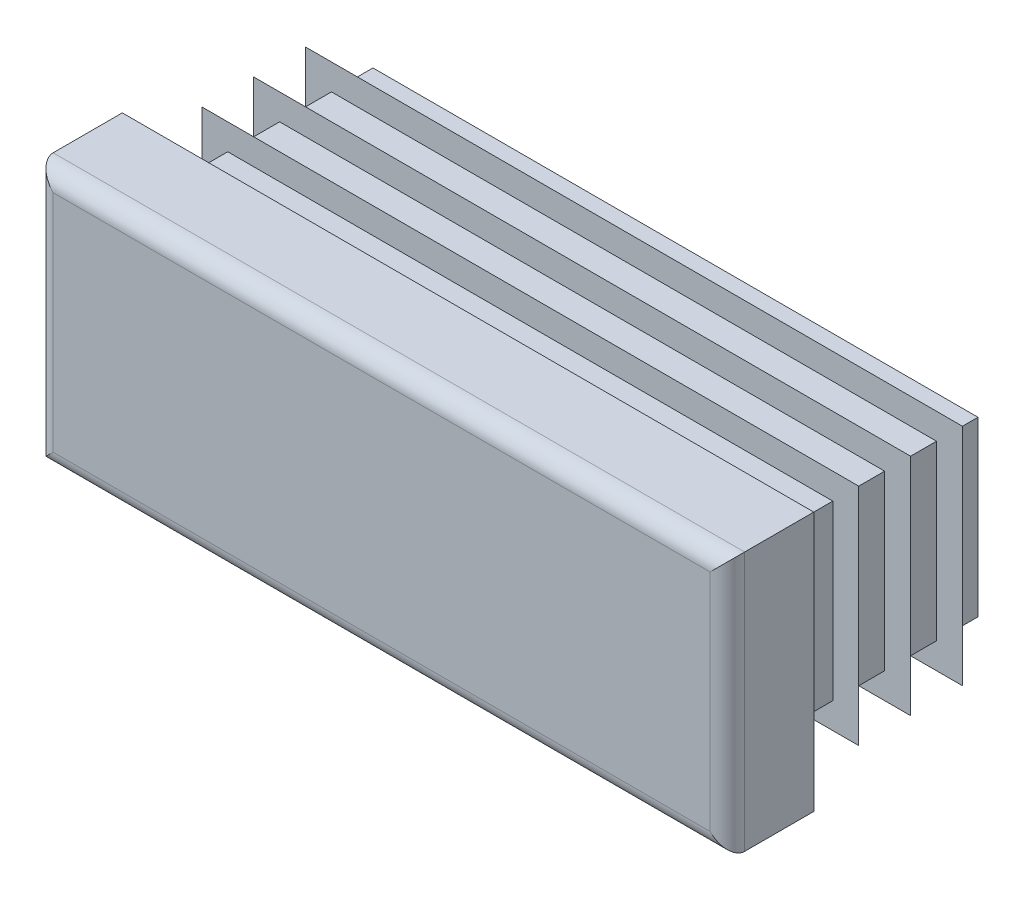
ISO-10303-21;
HEADER;
FILE_DESCRIPTION(('STEP AP214'),'2;1');
FILE_NAME('part.step','',(''),(''),'','','');
FILE_SCHEMA(('AUTOMOTIVE_DESIGN { 1 0 10303 214 1 1 1 1 }'));
ENDSEC;
DATA;
#1=APPLICATION_CONTEXT('core data for automotive mechanical design processes');
#2=APPLICATION_PROTOCOL_DEFINITION('international standard','automotive_design',2000,#1);
#3=PRODUCT_CONTEXT('',#1,'mechanical');
#4=PRODUCT('Part','Part','',(#3));
#5=PRODUCT_RELATED_PRODUCT_CATEGORY('part','',(#4));
#6=PRODUCT_DEFINITION_FORMATION('','',#4);
#7=PRODUCT_DEFINITION_CONTEXT('part definition',#1,'design');
#8=PRODUCT_DEFINITION('design','',#6,#7);
#9=PRODUCT_DEFINITION_SHAPE('','',#8);
#10=(LENGTH_UNIT() NAMED_UNIT(*) SI_UNIT(.MILLI.,.METRE.));
#11=(NAMED_UNIT(*) PLANE_ANGLE_UNIT() SI_UNIT($,.RADIAN.));
#12=(NAMED_UNIT(*) SI_UNIT($,.STERADIAN.) SOLID_ANGLE_UNIT());
#13=UNCERTAINTY_MEASURE_WITH_UNIT(LENGTH_MEASURE(1.E-05),#10,'distance_accuracy_value','');
#14=(GEOMETRIC_REPRESENTATION_CONTEXT(3) GLOBAL_UNCERTAINTY_ASSIGNED_CONTEXT((#13)) GLOBAL_UNIT_ASSIGNED_CONTEXT((#10,
#11,#12)) REPRESENTATION_CONTEXT('',''));
#15=CARTESIAN_POINT('',(0.,0.,0.));
#16=DIRECTION('',(0.,0.,1.));
#17=DIRECTION('',(1.,0.,0.));
#18=AXIS2_PLACEMENT_3D('',#15,#16,#17);
#19=CARTESIAN_POINT('',(19.,-7.5,5.));
#20=DIRECTION('',(0.,0.,-1.));
#21=DIRECTION('',(0.,1.,0.));
#22=AXIS2_PLACEMENT_3D('',#19,#20,#21);
#23=PLANE('',#22);
#24=DIRECTION('',(0.,1.,0.));
#25=VECTOR('',#24,1.);
#26=CARTESIAN_POINT('',(-19.,-7.5,5.));
#27=LINE('',#26,#25);
#28=CARTESIAN_POINT('',(-19.,-6.5,5.));
#29=VERTEX_POINT('',#28);
#30=CARTESIAN_POINT('',(-19.,6.5,5.));
#31=VERTEX_POINT('',#30);
#32=EDGE_CURVE('E310',#29,#31,#27,.T.);
#33=ORIENTED_EDGE('',*,*,#32,.F.);
#34=DIRECTION('',(-1.,0.,0.));
#35=VECTOR('',#34,1.);
#36=CARTESIAN_POINT('',(20.,-6.5,5.));
#37=LINE('',#36,#35);
#38=CARTESIAN_POINT('',(19.,-6.5,5.));
#39=VERTEX_POINT('',#38);
#40=EDGE_CURVE('E482',#39,#29,#37,.T.);
#41=ORIENTED_EDGE('',*,*,#40,.F.);
#42=DIRECTION('',(0.,1.,0.));
#43=VECTOR('',#42,1.);
#44=CARTESIAN_POINT('',(19.,-7.5,5.));
#45=LINE('',#44,#43);
#46=CARTESIAN_POINT('',(19.,6.5,5.));
#47=VERTEX_POINT('',#46);
#48=EDGE_CURVE('E305',#39,#47,#45,.T.);
#49=ORIENTED_EDGE('',*,*,#48,.T.);
#50=DIRECTION('',(-1.,0.,0.));
#51=VECTOR('',#50,1.);
#52=CARTESIAN_POINT('',(20.,6.5,5.));
#53=LINE('',#52,#51);
#54=EDGE_CURVE('E630',#47,#31,#53,.T.);
#55=ORIENTED_EDGE('',*,*,#54,.T.);
#56=EDGE_LOOP('',(#33,#41,#49,#55));
#57=FACE_BOUND('',#56,.T.);
#58=ADVANCED_FACE('F14',(#57),#23,.F.);
#59=CARTESIAN_POINT('',(-19.,-7.5,4.));
#60=DIRECTION('',(0.,1.,0.));
#61=DIRECTION('',(-1.,0.,0.));
#62=AXIS2_PLACEMENT_3D('',#59,#60,#61);
#63=CYLINDRICAL_SURFACE('',#62,1.);
#64=DIRECTION('',(0.,1.,0.));
#65=VECTOR('',#64,1.);
#66=CARTESIAN_POINT('',(-20.,-7.5,4.));
#67=LINE('',#66,#65);
#68=CARTESIAN_POINT('',(-20.,-7.5,4.));
#69=VERTEX_POINT('',#68);
#70=CARTESIAN_POINT('',(-20.,7.5,4.));
#71=VERTEX_POINT('',#70);
#72=EDGE_CURVE('E402',#69,#71,#67,.T.);
#73=ORIENTED_EDGE('',*,*,#72,.F.);
#74=CARTESIAN_POINT('',(-19.,-6.5,4.));
#75=DIRECTION('',(-0.707106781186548,0.707106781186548,0.));
#76=DIRECTION('',(0.707106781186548,0.707106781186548,0.));
#77=AXIS2_PLACEMENT_3D('',#74,#75,#76);
#78=ELLIPSE('',#77,1.41421356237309,1.);
#79=EDGE_CURVE('E59',#69,#29,#78,.T.);
#80=ORIENTED_EDGE('',*,*,#79,.T.);
#81=ORIENTED_EDGE('',*,*,#32,.T.);
#82=CARTESIAN_POINT('',(-19.,6.5,4.));
#83=DIRECTION('',(0.707106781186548,0.707106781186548,0.));
#84=DIRECTION('',(-0.707106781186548,0.707106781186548,0.));
#85=AXIS2_PLACEMENT_3D('',#82,#83,#84);
#86=ELLIPSE('',#85,1.41421356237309,1.);
#87=EDGE_CURVE('E306',#31,#71,#86,.F.);
#88=ORIENTED_EDGE('',*,*,#87,.T.);
#89=EDGE_LOOP('',(#73,#80,#81,#88));
#90=FACE_BOUND('',#89,.T.);
#91=ADVANCED_FACE('F16',(#90),#63,.T.);
#92=CARTESIAN_POINT('',(-20.,-7.5,4.));
#93=DIRECTION('',(1.,0.,0.));
#94=DIRECTION('',(0.,1.,0.));
#95=AXIS2_PLACEMENT_3D('',#92,#93,#94);
#96=PLANE('',#95);
#97=DIRECTION('',(0.,0.,-1.));
#98=VECTOR('',#97,1.);
#99=CARTESIAN_POINT('',(-20.,7.5,4.));
#100=LINE('',#99,#98);
#101=CARTESIAN_POINT('',(-20.,7.5,0.));
#102=VERTEX_POINT('',#101);
#103=EDGE_CURVE('E615',#71,#102,#100,.T.);
#104=ORIENTED_EDGE('',*,*,#103,.T.);
#105=DIRECTION('',(0.,1.,0.));
#106=VECTOR('',#105,1.);
#107=CARTESIAN_POINT('',(-20.,-7.5,0.));
#108=LINE('',#107,#106);
#109=CARTESIAN_POINT('',(-20.,-7.5,0.));
#110=VERTEX_POINT('',#109);
#111=EDGE_CURVE('E400',#110,#102,#108,.T.);
#112=ORIENTED_EDGE('',*,*,#111,.F.);
#113=DIRECTION('',(0.,0.,-1.));
#114=VECTOR('',#113,1.);
#115=CARTESIAN_POINT('',(-20.,-7.5,4.));
#116=LINE('',#115,#114);
#117=EDGE_CURVE('E616',#69,#110,#116,.T.);
#118=ORIENTED_EDGE('',*,*,#117,.F.);
#119=ORIENTED_EDGE('',*,*,#72,.T.);
#120=EDGE_LOOP('',(#104,#112,#118,#119));
#121=FACE_BOUND('',#120,.T.);
#122=ADVANCED_FACE('F697',(#121),#96,.F.);
#123=CARTESIAN_POINT('',(-17.5,-7.5,0.));
#124=DIRECTION('',(1.,0.,0.));
#125=DIRECTION('',(0.,1.,0.));
#126=AXIS2_PLACEMENT_3D('',#123,#124,#125);
#127=PLANE('',#126);
#128=DIRECTION('',(0.,1.,0.));
#129=VECTOR('',#128,1.);
#130=CARTESIAN_POINT('',(-17.5,-7.5,0.));
#131=LINE('',#130,#129);
#132=CARTESIAN_POINT('',(-17.5,-5.,0.));
#133=VERTEX_POINT('',#132);
#134=CARTESIAN_POINT('',(-17.5,5.,0.));
#135=VERTEX_POINT('',#134);
#136=EDGE_CURVE('E397',#133,#135,#131,.T.);
#137=ORIENTED_EDGE('',*,*,#136,.T.);
#138=DIRECTION('',(0.,0.,-1.));
#139=VECTOR('',#138,1.);
#140=CARTESIAN_POINT('',(-17.5,5.,0.));
#141=LINE('',#140,#139);
#142=CARTESIAN_POINT('',(-17.5,5.,-0.6));
#143=VERTEX_POINT('',#142);
#144=EDGE_CURVE('E495',#135,#143,#141,.T.);
#145=ORIENTED_EDGE('',*,*,#144,.T.);
#146=DIRECTION('',(0.,1.,0.));
#147=VECTOR('',#146,1.);
#148=CARTESIAN_POINT('',(-17.5,-7.5,-0.6));
#149=LINE('',#148,#147);
#150=CARTESIAN_POINT('',(-17.5,-5.,-0.6));
#151=VERTEX_POINT('',#150);
#152=EDGE_CURVE('E394',#151,#143,#149,.T.);
#153=ORIENTED_EDGE('',*,*,#152,.F.);
#154=DIRECTION('',(0.,0.,1.));
#155=VECTOR('',#154,1.);
#156=CARTESIAN_POINT('',(-17.5,-5.,0.));
#157=LINE('',#156,#155);
#158=EDGE_CURVE('E489',#151,#133,#157,.T.);
#159=ORIENTED_EDGE('',*,*,#158,.T.);
#160=EDGE_LOOP('',(#137,#145,#153,#159));
#161=FACE_BOUND('',#160,.T.);
#162=ADVANCED_FACE('F787',(#161),#127,.F.);
#163=CARTESIAN_POINT('',(-19.,-7.5,-0.6));
#164=DIRECTION('',(0.342020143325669,0.,0.939692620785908));
#165=DIRECTION('',(-0.939692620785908,0.,0.342020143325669));
#166=AXIS2_PLACEMENT_3D('',#163,#164,#165);
#167=PLANE('',#166);
#168=DIRECTION('',(0.,1.,0.));
#169=VECTOR('',#168,1.);
#170=CARTESIAN_POINT('',(-19.,-7.5,-0.6));
#171=LINE('',#170,#169);
#172=CARTESIAN_POINT('',(-19.,-6.5,-0.6));
#173=VERTEX_POINT('',#172);
#174=CARTESIAN_POINT('',(-19.,6.5,-0.6));
#175=VERTEX_POINT('',#174);
#176=EDGE_CURVE('E392',#173,#175,#171,.T.);
#177=ORIENTED_EDGE('',*,*,#176,.T.);
#178=DIRECTION('',(0.844349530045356,-0.438895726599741,-0.307318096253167));
#179=VECTOR('',#178,1.);
#180=CARTESIAN_POINT('',(-13.8118603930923,3.80318757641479,-2.48832838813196));
#181=LINE('',#180,#179);
#182=CARTESIAN_POINT('',(-17.5,5.7202949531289,-1.1459553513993));
#183=VERTEX_POINT('',#182);
#184=EDGE_CURVE('E519',#175,#183,#181,.T.);
#185=ORIENTED_EDGE('',*,*,#184,.T.);
#186=DIRECTION('',(0.,1.,0.));
#187=VECTOR('',#186,1.);
#188=CARTESIAN_POINT('',(-17.5,-7.5,-1.1459553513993));
#189=LINE('',#188,#187);
#190=CARTESIAN_POINT('',(-17.5,-5.72029495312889,-1.1459553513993));
#191=VERTEX_POINT('',#190);
#192=EDGE_CURVE('E389',#191,#183,#189,.T.);
#193=ORIENTED_EDGE('',*,*,#192,.F.);
#194=DIRECTION('',(-0.844349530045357,-0.438895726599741,0.307318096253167));
#195=VECTOR('',#194,1.);
#196=CARTESIAN_POINT('',(-19.3705814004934,-6.69262945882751,-0.465119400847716));
#197=LINE('',#196,#195);
#198=EDGE_CURVE('E507',#191,#173,#197,.T.);
#199=ORIENTED_EDGE('',*,*,#198,.T.);
#200=EDGE_LOOP('',(#177,#185,#193,#199));
#201=FACE_BOUND('',#200,.T.);
#202=ADVANCED_FACE('F783',(#201),#167,.F.);
#203=CARTESIAN_POINT('',(-17.5,-7.5,-1.1459553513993));
#204=DIRECTION('',(1.,0.,0.));
#205=DIRECTION('',(0.,1.,0.));
#206=AXIS2_PLACEMENT_3D('',#203,#204,#205);
#207=PLANE('',#206);
#208=ORIENTED_EDGE('',*,*,#192,.T.);
#209=DIRECTION('',(0.,-0.819152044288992,-0.573576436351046));
#210=VECTOR('',#209,1.);
#211=CARTESIAN_POINT('',(-17.5,-3.15065611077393,-7.35746215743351));
#212=LINE('',#211,#210);
#213=CARTESIAN_POINT('',(-17.5,5.,-1.65031130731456));
#214=VERTEX_POINT('',#213);
#215=EDGE_CURVE('E516',#183,#214,#212,.T.);
#216=ORIENTED_EDGE('',*,*,#215,.T.);
#217=DIRECTION('',(0.,0.,-1.));
#218=VECTOR('',#217,1.);
#219=CARTESIAN_POINT('',(-17.5,5.,-1.1459553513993));
#220=LINE('',#219,#218);
#221=CARTESIAN_POINT('',(-17.5,5.,-3.6));
#222=VERTEX_POINT('',#221);
#223=EDGE_CURVE('E525',#214,#222,#220,.T.);
#224=ORIENTED_EDGE('',*,*,#223,.T.);
#225=DIRECTION('',(0.,1.,0.));
#226=VECTOR('',#225,1.);
#227=CARTESIAN_POINT('',(-17.5,-7.5,-3.6));
#228=LINE('',#227,#226);
#229=CARTESIAN_POINT('',(-17.5,-5.,-3.6));
#230=VERTEX_POINT('',#229);
#231=EDGE_CURVE('E386',#230,#222,#228,.T.);
#232=ORIENTED_EDGE('',*,*,#231,.F.);
#233=DIRECTION('',(0.,0.,1.));
#234=VECTOR('',#233,1.);
#235=CARTESIAN_POINT('',(-17.5,-5.,-1.1459553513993));
#236=LINE('',#235,#234);
#237=CARTESIAN_POINT('',(-17.5,-5.,-1.65031130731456));
#238=VERTEX_POINT('',#237);
#239=EDGE_CURVE('E522',#230,#238,#236,.T.);
#240=ORIENTED_EDGE('',*,*,#239,.T.);
#241=DIRECTION('',(0.,-0.819152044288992,0.573576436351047));
#242=VECTOR('',#241,1.);
#243=CARTESIAN_POINT('',(-17.5,-6.91449496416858,-0.309767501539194));
#244=LINE('',#243,#242);
#245=EDGE_CURVE('E504',#238,#191,#244,.T.);
#246=ORIENTED_EDGE('',*,*,#245,.T.);
#247=EDGE_LOOP('',(#208,#216,#224,#232,#240,#246));
#248=FACE_BOUND('',#247,.T.);
#249=ADVANCED_FACE('F779',(#248),#207,.F.);
#250=CARTESIAN_POINT('',(-19.,-7.5,-3.6));
#251=DIRECTION('',(0.342020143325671,0.,0.939692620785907));
#252=DIRECTION('',(-0.939692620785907,0.,0.342020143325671));
#253=AXIS2_PLACEMENT_3D('',#250,#251,#252);
#254=PLANE('',#253);
#255=DIRECTION('',(0.,1.,0.));
#256=VECTOR('',#255,1.);
#257=CARTESIAN_POINT('',(-19.,-7.5,-3.6));
#258=LINE('',#257,#256);
#259=CARTESIAN_POINT('',(-19.,-6.5,-3.6));
#260=VERTEX_POINT('',#259);
#261=CARTESIAN_POINT('',(-19.,6.5,-3.6));
#262=VERTEX_POINT('',#261);
#263=EDGE_CURVE('E384',#260,#262,#258,.T.);
#264=ORIENTED_EDGE('',*,*,#263,.T.);
#265=DIRECTION('',(0.844349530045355,-0.438895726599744,-0.307318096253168));
#266=VECTOR('',#265,1.);
#267=CARTESIAN_POINT('',(-13.8118603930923,3.80318757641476,-5.48832838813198));
#268=LINE('',#267,#266);
#269=CARTESIAN_POINT('',(-17.5,5.72029495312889,-4.14595535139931));
#270=VERTEX_POINT('',#269);
#271=EDGE_CURVE('E549',#262,#270,#268,.T.);
#272=ORIENTED_EDGE('',*,*,#271,.T.);
#273=DIRECTION('',(0.,1.,0.));
#274=VECTOR('',#273,1.);
#275=CARTESIAN_POINT('',(-17.5,-7.5,-4.14595535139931));
#276=LINE('',#275,#274);
#277=CARTESIAN_POINT('',(-17.5,-5.72029495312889,-4.14595535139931));
#278=VERTEX_POINT('',#277);
#279=EDGE_CURVE('E381',#278,#270,#276,.T.);
#280=ORIENTED_EDGE('',*,*,#279,.F.);
#281=DIRECTION('',(-0.844349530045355,-0.438895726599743,0.307318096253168));
#282=VECTOR('',#281,1.);
#283=CARTESIAN_POINT('',(-19.3705814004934,-6.69262945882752,-3.46511940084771));
#284=LINE('',#283,#282);
#285=EDGE_CURVE('E537',#278,#260,#284,.T.);
#286=ORIENTED_EDGE('',*,*,#285,.T.);
#287=EDGE_LOOP('',(#264,#272,#280,#286));
#288=FACE_BOUND('',#287,.T.);
#289=ADVANCED_FACE('F775',(#288),#254,.F.);
#290=CARTESIAN_POINT('',(-17.5,-7.5,-4.14595535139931));
#291=DIRECTION('',(1.,0.,0.));
#292=DIRECTION('',(0.,1.,0.));
#293=AXIS2_PLACEMENT_3D('',#290,#291,#292);
#294=PLANE('',#293);
#295=ORIENTED_EDGE('',*,*,#279,.T.);
#296=DIRECTION('',(0.,-0.819152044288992,-0.573576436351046));
#297=VECTOR('',#296,1.);
#298=CARTESIAN_POINT('',(-17.5,-3.15065611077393,-10.3574621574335));
#299=LINE('',#298,#297);
#300=CARTESIAN_POINT('',(-17.5,5.,-4.65031130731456));
#301=VERTEX_POINT('',#300);
#302=EDGE_CURVE('E546',#270,#301,#299,.T.);
#303=ORIENTED_EDGE('',*,*,#302,.T.);
#304=DIRECTION('',(0.,0.,-1.));
#305=VECTOR('',#304,1.);
#306=CARTESIAN_POINT('',(-17.5,5.,-4.14595535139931));
#307=LINE('',#306,#305);
#308=CARTESIAN_POINT('',(-17.5,5.,-6.6));
#309=VERTEX_POINT('',#308);
#310=EDGE_CURVE('E555',#301,#309,#307,.T.);
#311=ORIENTED_EDGE('',*,*,#310,.T.);
#312=DIRECTION('',(0.,1.,0.));
#313=VECTOR('',#312,1.);
#314=CARTESIAN_POINT('',(-17.5,-7.5,-6.6));
#315=LINE('',#314,#313);
#316=CARTESIAN_POINT('',(-17.5,-5.,-6.6));
#317=VERTEX_POINT('',#316);
#318=EDGE_CURVE('E378',#317,#309,#315,.T.);
#319=ORIENTED_EDGE('',*,*,#318,.F.);
#320=DIRECTION('',(0.,0.,1.));
#321=VECTOR('',#320,1.);
#322=CARTESIAN_POINT('',(-17.5,-5.,-4.14595535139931));
#323=LINE('',#322,#321);
#324=CARTESIAN_POINT('',(-17.5,-5.,-4.65031130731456));
#325=VERTEX_POINT('',#324);
#326=EDGE_CURVE('E552',#317,#325,#323,.T.);
#327=ORIENTED_EDGE('',*,*,#326,.T.);
#328=DIRECTION('',(0.,-0.819152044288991,0.573576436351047));
#329=VECTOR('',#328,1.);
#330=CARTESIAN_POINT('',(-17.5,-6.91449496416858,-3.30976750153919));
#331=LINE('',#330,#329);
#332=EDGE_CURVE('E534',#325,#278,#331,.T.);
#333=ORIENTED_EDGE('',*,*,#332,.T.);
#334=EDGE_LOOP('',(#295,#303,#311,#319,#327,#333));
#335=FACE_BOUND('',#334,.T.);
#336=ADVANCED_FACE('F771',(#335),#294,.F.);
#337=CARTESIAN_POINT('',(-19.,-7.5,-6.6));
#338=DIRECTION('',(0.342020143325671,0.,0.939692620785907));
#339=DIRECTION('',(-0.939692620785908,0.,0.342020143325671));
#340=AXIS2_PLACEMENT_3D('',#337,#338,#339);
#341=PLANE('',#340);
#342=DIRECTION('',(0.,1.,0.));
#343=VECTOR('',#342,1.);
#344=CARTESIAN_POINT('',(-19.,-7.5,-6.6));
#345=LINE('',#344,#343);
#346=CARTESIAN_POINT('',(-19.,-6.5,-6.6));
#347=VERTEX_POINT('',#346);
#348=CARTESIAN_POINT('',(-19.,6.5,-6.6));
#349=VERTEX_POINT('',#348);
#350=EDGE_CURVE('E376',#347,#349,#345,.T.);
#351=ORIENTED_EDGE('',*,*,#350,.T.);
#352=DIRECTION('',(0.844349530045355,-0.438895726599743,-0.307318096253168));
#353=VECTOR('',#352,1.);
#354=CARTESIAN_POINT('',(-13.8118603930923,3.80318757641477,-8.48832838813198));
#355=LINE('',#354,#353);
#356=CARTESIAN_POINT('',(-17.5,5.7202949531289,-7.1459553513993));
#357=VERTEX_POINT('',#356);
#358=EDGE_CURVE('E579',#349,#357,#355,.T.);
#359=ORIENTED_EDGE('',*,*,#358,.T.);
#360=DIRECTION('',(0.,1.,0.));
#361=VECTOR('',#360,1.);
#362=CARTESIAN_POINT('',(-17.5,-7.5,-7.1459553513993));
#363=LINE('',#362,#361);
#364=CARTESIAN_POINT('',(-17.5,-5.72029495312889,-7.1459553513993));
#365=VERTEX_POINT('',#364);
#366=EDGE_CURVE('E373',#365,#357,#363,.T.);
#367=ORIENTED_EDGE('',*,*,#366,.F.);
#368=DIRECTION('',(-0.844349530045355,-0.438895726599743,0.307318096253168));
#369=VECTOR('',#368,1.);
#370=CARTESIAN_POINT('',(-19.3705814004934,-6.69262945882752,-6.46511940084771));
#371=LINE('',#370,#369);
#372=EDGE_CURVE('E567',#365,#347,#371,.T.);
#373=ORIENTED_EDGE('',*,*,#372,.T.);
#374=EDGE_LOOP('',(#351,#359,#367,#373));
#375=FACE_BOUND('',#374,.T.);
#376=ADVANCED_FACE('F767',(#375),#341,.F.);
#377=CARTESIAN_POINT('',(-17.5,-7.5,-7.1459553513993));
#378=DIRECTION('',(1.,0.,0.));
#379=DIRECTION('',(0.,1.,0.));
#380=AXIS2_PLACEMENT_3D('',#377,#378,#379);
#381=PLANE('',#380);
#382=ORIENTED_EDGE('',*,*,#366,.T.);
#383=DIRECTION('',(0.,-0.819152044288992,-0.573576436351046));
#384=VECTOR('',#383,1.);
#385=CARTESIAN_POINT('',(-17.5,-3.15065611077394,-13.3574621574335));
#386=LINE('',#385,#384);
#387=CARTESIAN_POINT('',(-17.5,5.,-7.65031130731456));
#388=VERTEX_POINT('',#387);
#389=EDGE_CURVE('E576',#357,#388,#386,.T.);
#390=ORIENTED_EDGE('',*,*,#389,.T.);
#391=DIRECTION('',(0.,0.,-1.));
#392=VECTOR('',#391,1.);
#393=CARTESIAN_POINT('',(-17.5,5.,-7.1459553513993));
#394=LINE('',#393,#392);
#395=CARTESIAN_POINT('',(-17.5,5.,-9.6));
#396=VERTEX_POINT('',#395);
#397=EDGE_CURVE('E585',#388,#396,#394,.T.);
#398=ORIENTED_EDGE('',*,*,#397,.T.);
#399=DIRECTION('',(0.,1.,0.));
#400=VECTOR('',#399,1.);
#401=CARTESIAN_POINT('',(-17.5,-7.5,-9.6));
#402=LINE('',#401,#400);
#403=CARTESIAN_POINT('',(-17.5,-5.,-9.6));
#404=VERTEX_POINT('',#403);
#405=EDGE_CURVE('E370',#404,#396,#402,.T.);
#406=ORIENTED_EDGE('',*,*,#405,.F.);
#407=DIRECTION('',(0.,0.,1.));
#408=VECTOR('',#407,1.);
#409=CARTESIAN_POINT('',(-17.5,-5.,-7.1459553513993));
#410=LINE('',#409,#408);
#411=CARTESIAN_POINT('',(-17.5,-5.,-7.65031130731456));
#412=VERTEX_POINT('',#411);
#413=EDGE_CURVE('E582',#404,#412,#410,.T.);
#414=ORIENTED_EDGE('',*,*,#413,.T.);
#415=DIRECTION('',(0.,-0.819152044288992,0.573576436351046));
#416=VECTOR('',#415,1.);
#417=CARTESIAN_POINT('',(-17.5,-6.91449496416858,-6.30976750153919));
#418=LINE('',#417,#416);
#419=EDGE_CURVE('E564',#412,#365,#418,.T.);
#420=ORIENTED_EDGE('',*,*,#419,.T.);
#421=EDGE_LOOP('',(#382,#390,#398,#406,#414,#420));
#422=FACE_BOUND('',#421,.T.);
#423=ADVANCED_FACE('F764',(#422),#381,.F.);
#424=CARTESIAN_POINT('',(-19.,-7.5,-9.6));
#425=DIRECTION('',(0.342020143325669,0.,0.939692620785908));
#426=DIRECTION('',(-0.939692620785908,0.,0.342020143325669));
#427=AXIS2_PLACEMENT_3D('',#424,#425,#426);
#428=PLANE('',#427);
#429=DIRECTION('',(0.,1.,0.));
#430=VECTOR('',#429,1.);
#431=CARTESIAN_POINT('',(-19.,-7.5,-9.6));
#432=LINE('',#431,#430);
#433=CARTESIAN_POINT('',(-19.,-6.5,-9.6));
#434=VERTEX_POINT('',#433);
#435=CARTESIAN_POINT('',(-19.,6.5,-9.6));
#436=VERTEX_POINT('',#435);
#437=EDGE_CURVE('E368',#434,#436,#432,.T.);
#438=ORIENTED_EDGE('',*,*,#437,.T.);
#439=DIRECTION('',(0.844349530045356,-0.438895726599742,-0.307318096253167));
#440=VECTOR('',#439,1.);
#441=CARTESIAN_POINT('',(-13.8118603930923,3.80318757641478,-11.488328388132));
#442=LINE('',#441,#440);
#443=CARTESIAN_POINT('',(-17.5,5.7202949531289,-10.1459553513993));
#444=VERTEX_POINT('',#443);
#445=EDGE_CURVE('E607',#436,#444,#442,.T.);
#446=ORIENTED_EDGE('',*,*,#445,.T.);
#447=DIRECTION('',(0.,1.,0.));
#448=VECTOR('',#447,1.);
#449=CARTESIAN_POINT('',(-17.5,-7.5,-10.1459553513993));
#450=LINE('',#449,#448);
#451=CARTESIAN_POINT('',(-17.5,-5.7202949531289,-10.1459553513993));
#452=VERTEX_POINT('',#451);
#453=EDGE_CURVE('E365',#452,#444,#450,.T.);
#454=ORIENTED_EDGE('',*,*,#453,.F.);
#455=DIRECTION('',(-0.844349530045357,-0.438895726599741,0.307318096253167));
#456=VECTOR('',#455,1.);
#457=CARTESIAN_POINT('',(-19.3705814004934,-6.69262945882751,-9.46511940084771));
#458=LINE('',#457,#456);
#459=EDGE_CURVE('E595',#452,#434,#458,.T.);
#460=ORIENTED_EDGE('',*,*,#459,.T.);
#461=EDGE_LOOP('',(#438,#446,#454,#460));
#462=FACE_BOUND('',#461,.T.);
#463=ADVANCED_FACE('F675',(#462),#428,.F.);
#464=CARTESIAN_POINT('',(-17.5,-7.5,-10.1459553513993));
#465=DIRECTION('',(1.,0.,0.));
#466=DIRECTION('',(0.,1.,0.));
#467=AXIS2_PLACEMENT_3D('',#464,#465,#466);
#468=PLANE('',#467);
#469=ORIENTED_EDGE('',*,*,#453,.T.);
#470=DIRECTION('',(0.,-0.819152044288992,-0.573576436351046));
#471=VECTOR('',#470,1.);
#472=CARTESIAN_POINT('',(-17.5,-3.15065611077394,-16.3574621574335));
#473=LINE('',#472,#471);
#474=CARTESIAN_POINT('',(-17.5,5.,-10.6503113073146));
#475=VERTEX_POINT('',#474);
#476=EDGE_CURVE('E604',#444,#475,#473,.T.);
#477=ORIENTED_EDGE('',*,*,#476,.T.);
#478=DIRECTION('',(0.,0.,-1.));
#479=VECTOR('',#478,1.);
#480=CARTESIAN_POINT('',(-17.5,5.,-10.1459553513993));
#481=LINE('',#480,#479);
#482=CARTESIAN_POINT('',(-17.5,5.,-12.));
#483=VERTEX_POINT('',#482);
#484=EDGE_CURVE('E613',#475,#483,#481,.T.);
#485=ORIENTED_EDGE('',*,*,#484,.T.);
#486=DIRECTION('',(0.,1.,0.));
#487=VECTOR('',#486,1.);
#488=CARTESIAN_POINT('',(-17.5,-7.5,-12.));
#489=LINE('',#488,#487);
#490=CARTESIAN_POINT('',(-17.5,-5.,-12.));
#491=VERTEX_POINT('',#490);
#492=EDGE_CURVE('E362',#491,#483,#489,.T.);
#493=ORIENTED_EDGE('',*,*,#492,.F.);
#494=DIRECTION('',(0.,0.,1.));
#495=VECTOR('',#494,1.);
#496=CARTESIAN_POINT('',(-17.5,-5.,-10.1459553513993));
#497=LINE('',#496,#495);
#498=CARTESIAN_POINT('',(-17.5,-5.,-10.6503113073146));
#499=VERTEX_POINT('',#498);
#500=EDGE_CURVE('E610',#491,#499,#497,.T.);
#501=ORIENTED_EDGE('',*,*,#500,.T.);
#502=DIRECTION('',(0.,-0.819152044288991,0.573576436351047));
#503=VECTOR('',#502,1.);
#504=CARTESIAN_POINT('',(-17.5,-6.91449496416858,-9.30976750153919));
#505=LINE('',#504,#503);
#506=EDGE_CURVE('E592',#499,#452,#505,.T.);
#507=ORIENTED_EDGE('',*,*,#506,.T.);
#508=EDGE_LOOP('',(#469,#477,#485,#493,#501,#507));
#509=FACE_BOUND('',#508,.T.);
#510=ADVANCED_FACE('F677',(#509),#468,.F.);
#511=CARTESIAN_POINT('',(-17.5,-7.5,-12.));
#512=DIRECTION('',(0.,0.,1.));
#513=DIRECTION('',(0.,-1.,0.));
#514=AXIS2_PLACEMENT_3D('',#511,#512,#513);
#515=PLANE('',#514);
#516=ORIENTED_EDGE('',*,*,#492,.T.);
#517=DIRECTION('',(-1.,0.,0.));
#518=VECTOR('',#517,1.);
#519=CARTESIAN_POINT('',(20.,5.,-12.));
#520=LINE('',#519,#518);
#521=CARTESIAN_POINT('',(17.5,5.,-12.));
#522=VERTEX_POINT('',#521);
#523=EDGE_CURVE('E438',#522,#483,#520,.T.);
#524=ORIENTED_EDGE('',*,*,#523,.F.);
#525=DIRECTION('',(0.,1.,0.));
#526=VECTOR('',#525,1.);
#527=CARTESIAN_POINT('',(17.5,-7.5,-12.));
#528=LINE('',#527,#526);
#529=CARTESIAN_POINT('',(17.5,-5.,-12.));
#530=VERTEX_POINT('',#529);
#531=EDGE_CURVE('E359',#530,#522,#528,.T.);
#532=ORIENTED_EDGE('',*,*,#531,.F.);
#533=DIRECTION('',(-1.,0.,0.));
#534=VECTOR('',#533,1.);
#535=CARTESIAN_POINT('',(20.,-5.,-12.));
#536=LINE('',#535,#534);
#537=EDGE_CURVE('E436',#530,#491,#536,.T.);
#538=ORIENTED_EDGE('',*,*,#537,.T.);
#539=EDGE_LOOP('',(#516,#524,#532,#538));
#540=FACE_BOUND('',#539,.T.);
#541=ADVANCED_FACE('F435',(#540),#515,.F.);
#542=CARTESIAN_POINT('',(17.5,-7.5,-12.));
#543=DIRECTION('',(-1.,0.,0.));
#544=DIRECTION('',(0.,-1.,0.));
#545=AXIS2_PLACEMENT_3D('',#542,#543,#544);
#546=PLANE('',#545);
#547=DIRECTION('',(0.,0.,1.));
#548=VECTOR('',#547,1.);
#549=CARTESIAN_POINT('',(17.5,5.,-12.));
#550=LINE('',#549,#548);
#551=CARTESIAN_POINT('',(17.5,5.,-10.6503113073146));
#552=VERTEX_POINT('',#551);
#553=EDGE_CURVE('E9',#522,#552,#550,.T.);
#554=ORIENTED_EDGE('',*,*,#553,.T.);
#555=DIRECTION('',(0.,0.819152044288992,0.573576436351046));
#556=VECTOR('',#555,1.);
#557=CARTESIAN_POINT('',(17.5,-4.02177214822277,-16.9674241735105));
#558=LINE('',#557,#556);
#559=CARTESIAN_POINT('',(17.5,5.72029495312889,-10.1459553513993));
#560=VERTEX_POINT('',#559);
#561=EDGE_CURVE('E601',#552,#560,#558,.T.);
#562=ORIENTED_EDGE('',*,*,#561,.T.);
#563=DIRECTION('',(0.,1.,0.));
#564=VECTOR('',#563,1.);
#565=CARTESIAN_POINT('',(17.5,-7.5,-10.1459553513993));
#566=LINE('',#565,#564);
#567=CARTESIAN_POINT('',(17.5,-5.72029495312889,-10.1459553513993));
#568=VERTEX_POINT('',#567);
#569=EDGE_CURVE('E356',#568,#560,#566,.T.);
#570=ORIENTED_EDGE('',*,*,#569,.F.);
#571=DIRECTION('',(0.,0.819152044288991,-0.573576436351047));
#572=VECTOR('',#571,1.);
#573=CARTESIAN_POINT('',(17.5,-6.04337892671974,-9.91972951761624));
#574=LINE('',#573,#572);
#575=CARTESIAN_POINT('',(17.5,-5.,-10.6503113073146));
#576=VERTEX_POINT('',#575);
#577=EDGE_CURVE('E428',#568,#576,#574,.T.);
#578=ORIENTED_EDGE('',*,*,#577,.T.);
#579=DIRECTION('',(0.,0.,-1.));
#580=VECTOR('',#579,1.);
#581=CARTESIAN_POINT('',(17.5,-5.,-12.));
#582=LINE('',#581,#580);
#583=EDGE_CURVE('E23',#576,#530,#582,.T.);
#584=ORIENTED_EDGE('',*,*,#583,.T.);
#585=ORIENTED_EDGE('',*,*,#531,.T.);
#586=EDGE_LOOP('',(#554,#562,#570,#578,#584,#585));
#587=FACE_BOUND('',#586,.T.);
#588=ADVANCED_FACE('F426',(#587),#546,.F.);
#589=CARTESIAN_POINT('',(17.5,-7.5,-10.1459553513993));
#590=DIRECTION('',(-0.342020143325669,0.,0.939692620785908));
#591=DIRECTION('',(-0.939692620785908,0.,-0.342020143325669));
#592=AXIS2_PLACEMENT_3D('',#589,#590,#591);
#593=PLANE('',#592);
#594=ORIENTED_EDGE('',*,*,#569,.T.);
#595=DIRECTION('',(0.844349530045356,0.438895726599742,0.307318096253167));
#596=VECTOR('',#595,1.);
#597=CARTESIAN_POINT('',(12.6008045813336,3.17367669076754,-11.9291166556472));
#598=LINE('',#597,#596);
#599=CARTESIAN_POINT('',(19.,6.5,-9.6));
#600=VERTEX_POINT('',#599);
#601=EDGE_CURVE('E598',#560,#600,#598,.T.);
#602=ORIENTED_EDGE('',*,*,#601,.T.);
#603=DIRECTION('',(0.,1.,0.));
#604=VECTOR('',#603,1.);
#605=CARTESIAN_POINT('',(19.,-7.5,-9.6));
#606=LINE('',#605,#604);
#607=CARTESIAN_POINT('',(19.,-6.5,-9.6));
#608=VERTEX_POINT('',#607);
#609=EDGE_CURVE('E353',#608,#600,#606,.T.);
#610=ORIENTED_EDGE('',*,*,#609,.F.);
#611=DIRECTION('',(-0.844349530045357,0.438895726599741,-0.307318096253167));
#612=VECTOR('',#611,1.);
#613=CARTESIAN_POINT('',(18.1595255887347,-6.06311857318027,-9.90590766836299));
#614=LINE('',#613,#612);
#615=EDGE_CURVE('E588',#608,#568,#614,.T.);
#616=ORIENTED_EDGE('',*,*,#615,.T.);
#617=EDGE_LOOP('',(#594,#602,#610,#616));
#618=FACE_BOUND('',#617,.T.);
#619=ADVANCED_FACE('F752',(#618),#593,.F.);
#620=CARTESIAN_POINT('',(19.,-7.5,-9.6));
#621=DIRECTION('',(0.,0.,-1.));
#622=DIRECTION('',(0.,1.,0.));
#623=AXIS2_PLACEMENT_3D('',#620,#621,#622);
#624=PLANE('',#623);
#625=ORIENTED_EDGE('',*,*,#609,.T.);
#626=DIRECTION('',(-1.,0.,0.));
#627=VECTOR('',#626,1.);
#628=CARTESIAN_POINT('',(20.,6.5,-9.6));
#629=LINE('',#628,#627);
#630=EDGE_CURVE('E444',#600,#436,#629,.T.);
#631=ORIENTED_EDGE('',*,*,#630,.T.);
#632=ORIENTED_EDGE('',*,*,#437,.F.);
#633=DIRECTION('',(-1.,0.,0.));
#634=VECTOR('',#633,1.);
#635=CARTESIAN_POINT('',(20.,-6.5,-9.6));
#636=LINE('',#635,#634);
#637=EDGE_CURVE('E451',#608,#434,#636,.T.);
#638=ORIENTED_EDGE('',*,*,#637,.F.);
#639=EDGE_LOOP('',(#625,#631,#632,#638));
#640=FACE_BOUND('',#639,.T.);
#641=ORIENTED_EDGE('',*,*,#405,.T.);
#642=DIRECTION('',(-1.,0.,0.));
#643=VECTOR('',#642,1.);
#644=CARTESIAN_POINT('',(20.,5.,-9.6));
#645=LINE('',#644,#643);
#646=CARTESIAN_POINT('',(17.5,5.,-9.6));
#647=VERTEX_POINT('',#646);
#648=EDGE_CURVE('E663',#647,#396,#645,.T.);
#649=ORIENTED_EDGE('',*,*,#648,.F.);
#650=DIRECTION('',(0.,1.,0.));
#651=VECTOR('',#650,1.);
#652=CARTESIAN_POINT('',(17.5,-7.5,-9.6));
#653=LINE('',#652,#651);
#654=CARTESIAN_POINT('',(17.5,-5.,-9.6));
#655=VERTEX_POINT('',#654);
#656=EDGE_CURVE('E350',#655,#647,#653,.T.);
#657=ORIENTED_EDGE('',*,*,#656,.F.);
#658=DIRECTION('',(-1.,0.,0.));
#659=VECTOR('',#658,1.);
#660=CARTESIAN_POINT('',(20.,-5.,-9.6));
#661=LINE('',#660,#659);
#662=EDGE_CURVE('E453',#655,#404,#661,.T.);
#663=ORIENTED_EDGE('',*,*,#662,.T.);
#664=EDGE_LOOP('',(#641,#649,#657,#663));
#665=FACE_BOUND('',#664,.T.);
#666=ADVANCED_FACE('F667',(#640,#665),#624,.F.);
#667=CARTESIAN_POINT('',(17.5,-7.5,-9.6));
#668=DIRECTION('',(-1.,0.,0.));
#669=DIRECTION('',(0.,-1.,0.));
#670=AXIS2_PLACEMENT_3D('',#667,#668,#669);
#671=PLANE('',#670);
#672=DIRECTION('',(0.,0.,1.));
#673=VECTOR('',#672,1.);
#674=CARTESIAN_POINT('',(17.5,5.,-9.6));
#675=LINE('',#674,#673);
#676=CARTESIAN_POINT('',(17.5,5.,-7.65031130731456));
#677=VERTEX_POINT('',#676);
#678=EDGE_CURVE('E420',#647,#677,#675,.T.);
#679=ORIENTED_EDGE('',*,*,#678,.T.);
#680=DIRECTION('',(0.,0.819152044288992,0.573576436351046));
#681=VECTOR('',#680,1.);
#682=CARTESIAN_POINT('',(17.5,-4.30367993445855,-14.1648181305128));
#683=LINE('',#682,#681);
#684=CARTESIAN_POINT('',(17.5,5.72029495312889,-7.1459553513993));
#685=VERTEX_POINT('',#684);
#686=EDGE_CURVE('E573',#677,#685,#683,.T.);
#687=ORIENTED_EDGE('',*,*,#686,.T.);
#688=DIRECTION('',(0.,1.,0.));
#689=VECTOR('',#688,1.);
#690=CARTESIAN_POINT('',(17.5,-7.5,-7.1459553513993));
#691=LINE('',#690,#689);
#692=CARTESIAN_POINT('',(17.5,-5.72029495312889,-7.1459553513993));
#693=VERTEX_POINT('',#692);
#694=EDGE_CURVE('E347',#693,#685,#691,.T.);
#695=ORIENTED_EDGE('',*,*,#694,.F.);
#696=DIRECTION('',(0.,0.819152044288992,-0.573576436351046));
#697=VECTOR('',#696,1.);
#698=CARTESIAN_POINT('',(17.5,-5.76147114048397,-7.11712347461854));
#699=LINE('',#698,#697);
#700=CARTESIAN_POINT('',(17.5,-5.,-7.65031130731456));
#701=VERTEX_POINT('',#700);
#702=EDGE_CURVE('E561',#693,#701,#699,.T.);
#703=ORIENTED_EDGE('',*,*,#702,.T.);
#704=DIRECTION('',(0.,0.,-1.));
#705=VECTOR('',#704,1.);
#706=CARTESIAN_POINT('',(17.5,-5.,-9.6));
#707=LINE('',#706,#705);
#708=EDGE_CURVE('E417',#701,#655,#707,.T.);
#709=ORIENTED_EDGE('',*,*,#708,.T.);
#710=ORIENTED_EDGE('',*,*,#656,.T.);
#711=EDGE_LOOP('',(#679,#687,#695,#703,#709,#710));
#712=FACE_BOUND('',#711,.T.);
#713=ADVANCED_FACE('F745',(#712),#671,.F.);
#714=CARTESIAN_POINT('',(17.5,-7.5,-7.1459553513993));
#715=DIRECTION('',(-0.342020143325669,0.,0.939692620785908));
#716=DIRECTION('',(-0.939692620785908,0.,-0.342020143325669));
#717=AXIS2_PLACEMENT_3D('',#714,#715,#716);
#718=PLANE('',#717);
#719=ORIENTED_EDGE('',*,*,#694,.T.);
#720=DIRECTION('',(0.844349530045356,0.438895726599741,0.307318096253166));
#721=VECTOR('',#720,1.);
#722=CARTESIAN_POINT('',(12.6008045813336,3.17367669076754,-8.92911665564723));
#723=LINE('',#722,#721);
#724=CARTESIAN_POINT('',(19.,6.5,-6.6));
#725=VERTEX_POINT('',#724);
#726=EDGE_CURVE('E570',#685,#725,#723,.T.);
#727=ORIENTED_EDGE('',*,*,#726,.T.);
#728=DIRECTION('',(0.,1.,0.));
#729=VECTOR('',#728,1.);
#730=CARTESIAN_POINT('',(19.,-7.5,-6.6));
#731=LINE('',#730,#729);
#732=CARTESIAN_POINT('',(19.,-6.5,-6.6));
#733=VERTEX_POINT('',#732);
#734=EDGE_CURVE('E344',#733,#725,#731,.T.);
#735=ORIENTED_EDGE('',*,*,#734,.F.);
#736=DIRECTION('',(-0.844349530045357,0.438895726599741,-0.307318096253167));
#737=VECTOR('',#736,1.);
#738=CARTESIAN_POINT('',(18.1595255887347,-6.06311857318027,-6.90590766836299));
#739=LINE('',#738,#737);
#740=EDGE_CURVE('E558',#733,#693,#739,.T.);
#741=ORIENTED_EDGE('',*,*,#740,.T.);
#742=EDGE_LOOP('',(#719,#727,#735,#741));
#743=FACE_BOUND('',#742,.T.);
#744=ADVANCED_FACE('F741',(#743),#718,.F.);
#745=CARTESIAN_POINT('',(19.,-7.5,-6.6));
#746=DIRECTION('',(0.,0.,-1.));
#747=DIRECTION('',(0.,1.,0.));
#748=AXIS2_PLACEMENT_3D('',#745,#746,#747);
#749=PLANE('',#748);
#750=ORIENTED_EDGE('',*,*,#734,.T.);
#751=DIRECTION('',(-1.,0.,0.));
#752=VECTOR('',#751,1.);
#753=CARTESIAN_POINT('',(20.,6.5,-6.6));
#754=LINE('',#753,#752);
#755=EDGE_CURVE('E657',#725,#349,#754,.T.);
#756=ORIENTED_EDGE('',*,*,#755,.T.);
#757=ORIENTED_EDGE('',*,*,#350,.F.);
#758=DIRECTION('',(-1.,0.,0.));
#759=VECTOR('',#758,1.);
#760=CARTESIAN_POINT('',(20.,-6.5,-6.6));
#761=LINE('',#760,#759);
#762=EDGE_CURVE('E459',#733,#347,#761,.T.);
#763=ORIENTED_EDGE('',*,*,#762,.F.);
#764=EDGE_LOOP('',(#750,#756,#757,#763));
#765=FACE_BOUND('',#764,.T.);
#766=ORIENTED_EDGE('',*,*,#318,.T.);
#767=DIRECTION('',(-1.,0.,0.));
#768=VECTOR('',#767,1.);
#769=CARTESIAN_POINT('',(20.,5.,-6.6));
#770=LINE('',#769,#768);
#771=CARTESIAN_POINT('',(17.5,5.,-6.6));
#772=VERTEX_POINT('',#771);
#773=EDGE_CURVE('E655',#772,#309,#770,.T.);
#774=ORIENTED_EDGE('',*,*,#773,.F.);
#775=DIRECTION('',(0.,1.,0.));
#776=VECTOR('',#775,1.);
#777=CARTESIAN_POINT('',(17.5,-7.5,-6.6));
#778=LINE('',#777,#776);
#779=CARTESIAN_POINT('',(17.5,-5.,-6.6));
#780=VERTEX_POINT('',#779);
#781=EDGE_CURVE('E341',#780,#772,#778,.T.);
#782=ORIENTED_EDGE('',*,*,#781,.F.);
#783=DIRECTION('',(-1.,0.,0.));
#784=VECTOR('',#783,1.);
#785=CARTESIAN_POINT('',(20.,-5.,-6.6));
#786=LINE('',#785,#784);
#787=EDGE_CURVE('E461',#780,#317,#786,.T.);
#788=ORIENTED_EDGE('',*,*,#787,.T.);
#789=EDGE_LOOP('',(#766,#774,#782,#788));
#790=FACE_BOUND('',#789,.T.);
#791=ADVANCED_FACE('F737',(#765,#790),#749,.F.);
#792=CARTESIAN_POINT('',(17.5,-7.5,-6.6));
#793=DIRECTION('',(-1.,0.,0.));
#794=DIRECTION('',(0.,-1.,0.));
#795=AXIS2_PLACEMENT_3D('',#792,#793,#794);
#796=PLANE('',#795);
#797=DIRECTION('',(0.,0.,1.));
#798=VECTOR('',#797,1.);
#799=CARTESIAN_POINT('',(17.5,5.,-6.6));
#800=LINE('',#799,#798);
#801=CARTESIAN_POINT('',(17.5,5.,-4.65031130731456));
#802=VERTEX_POINT('',#801);
#803=EDGE_CURVE('E414',#772,#802,#800,.T.);
#804=ORIENTED_EDGE('',*,*,#803,.T.);
#805=DIRECTION('',(0.,0.819152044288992,0.573576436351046));
#806=VECTOR('',#805,1.);
#807=CARTESIAN_POINT('',(17.5,-4.30367993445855,-11.1648181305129));
#808=LINE('',#807,#806);
#809=CARTESIAN_POINT('',(17.5,5.7202949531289,-4.14595535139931));
#810=VERTEX_POINT('',#809);
#811=EDGE_CURVE('E543',#802,#810,#808,.T.);
#812=ORIENTED_EDGE('',*,*,#811,.T.);
#813=DIRECTION('',(0.,1.,0.));
#814=VECTOR('',#813,1.);
#815=CARTESIAN_POINT('',(17.5,-7.5,-4.14595535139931));
#816=LINE('',#815,#814);
#817=CARTESIAN_POINT('',(17.5,-5.72029495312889,-4.14595535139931));
#818=VERTEX_POINT('',#817);
#819=EDGE_CURVE('E338',#818,#810,#816,.T.);
#820=ORIENTED_EDGE('',*,*,#819,.F.);
#821=DIRECTION('',(0.,0.819152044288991,-0.573576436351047));
#822=VECTOR('',#821,1.);
#823=CARTESIAN_POINT('',(17.5,-5.76147114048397,-4.11712347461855));
#824=LINE('',#823,#822);
#825=CARTESIAN_POINT('',(17.5,-5.,-4.65031130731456));
#826=VERTEX_POINT('',#825);
#827=EDGE_CURVE('E531',#818,#826,#824,.T.);
#828=ORIENTED_EDGE('',*,*,#827,.T.);
#829=DIRECTION('',(0.,0.,-1.));
#830=VECTOR('',#829,1.);
#831=CARTESIAN_POINT('',(17.5,-5.,-6.6));
#832=LINE('',#831,#830);
#833=EDGE_CURVE('E411',#826,#780,#832,.T.);
#834=ORIENTED_EDGE('',*,*,#833,.T.);
#835=ORIENTED_EDGE('',*,*,#781,.T.);
#836=EDGE_LOOP('',(#804,#812,#820,#828,#834,#835));
#837=FACE_BOUND('',#836,.T.);
#838=ADVANCED_FACE('F733',(#837),#796,.F.);
#839=CARTESIAN_POINT('',(17.5,-7.5,-4.14595535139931));
#840=DIRECTION('',(-0.342020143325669,0.,0.939692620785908));
#841=DIRECTION('',(-0.939692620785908,0.,-0.342020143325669));
#842=AXIS2_PLACEMENT_3D('',#839,#840,#841);
#843=PLANE('',#842);
#844=ORIENTED_EDGE('',*,*,#819,.T.);
#845=DIRECTION('',(0.844349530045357,0.438895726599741,0.307318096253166));
#846=VECTOR('',#845,1.);
#847=CARTESIAN_POINT('',(12.6008045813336,3.17367669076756,-5.92911665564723));
#848=LINE('',#847,#846);
#849=CARTESIAN_POINT('',(19.,6.5,-3.6));
#850=VERTEX_POINT('',#849);
#851=EDGE_CURVE('E540',#810,#850,#848,.T.);
#852=ORIENTED_EDGE('',*,*,#851,.T.);
#853=DIRECTION('',(0.,1.,0.));
#854=VECTOR('',#853,1.);
#855=CARTESIAN_POINT('',(19.,-7.5,-3.6));
#856=LINE('',#855,#854);
#857=CARTESIAN_POINT('',(19.,-6.5,-3.6));
#858=VERTEX_POINT('',#857);
#859=EDGE_CURVE('E335',#858,#850,#856,.T.);
#860=ORIENTED_EDGE('',*,*,#859,.F.);
#861=DIRECTION('',(-0.844349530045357,0.43889572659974,-0.307318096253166));
#862=VECTOR('',#861,1.);
#863=CARTESIAN_POINT('',(18.1595255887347,-6.06311857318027,-3.90590766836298));
#864=LINE('',#863,#862);
#865=EDGE_CURVE('E528',#858,#818,#864,.T.);
#866=ORIENTED_EDGE('',*,*,#865,.T.);
#867=EDGE_LOOP('',(#844,#852,#860,#866));
#868=FACE_BOUND('',#867,.T.);
#869=ADVANCED_FACE('F729',(#868),#843,.F.);
#870=CARTESIAN_POINT('',(19.,-7.5,-3.6));
#871=DIRECTION('',(0.,0.,-1.));
#872=DIRECTION('',(0.,1.,0.));
#873=AXIS2_PLACEMENT_3D('',#870,#871,#872);
#874=PLANE('',#873);
#875=ORIENTED_EDGE('',*,*,#859,.T.);
#876=DIRECTION('',(-1.,0.,0.));
#877=VECTOR('',#876,1.);
#878=CARTESIAN_POINT('',(20.,6.5,-3.6));
#879=LINE('',#878,#877);
#880=EDGE_CURVE('E649',#850,#262,#879,.T.);
#881=ORIENTED_EDGE('',*,*,#880,.T.);
#882=ORIENTED_EDGE('',*,*,#263,.F.);
#883=DIRECTION('',(-1.,0.,0.));
#884=VECTOR('',#883,1.);
#885=CARTESIAN_POINT('',(20.,-6.5,-3.6));
#886=LINE('',#885,#884);
#887=EDGE_CURVE('E467',#858,#260,#886,.T.);
#888=ORIENTED_EDGE('',*,*,#887,.F.);
#889=EDGE_LOOP('',(#875,#881,#882,#888));
#890=FACE_BOUND('',#889,.T.);
#891=ORIENTED_EDGE('',*,*,#231,.T.);
#892=DIRECTION('',(-1.,0.,0.));
#893=VECTOR('',#892,1.);
#894=CARTESIAN_POINT('',(20.,5.,-3.6));
#895=LINE('',#894,#893);
#896=CARTESIAN_POINT('',(17.5,5.,-3.6));
#897=VERTEX_POINT('',#896);
#898=EDGE_CURVE('E647',#897,#222,#895,.T.);
#899=ORIENTED_EDGE('',*,*,#898,.F.);
#900=DIRECTION('',(0.,1.,0.));
#901=VECTOR('',#900,1.);
#902=CARTESIAN_POINT('',(17.5,-7.5,-3.6));
#903=LINE('',#902,#901);
#904=CARTESIAN_POINT('',(17.5,-5.,-3.6));
#905=VERTEX_POINT('',#904);
#906=EDGE_CURVE('E332',#905,#897,#903,.T.);
#907=ORIENTED_EDGE('',*,*,#906,.F.);
#908=DIRECTION('',(-1.,0.,0.));
#909=VECTOR('',#908,1.);
#910=CARTESIAN_POINT('',(20.,-5.,-3.6));
#911=LINE('',#910,#909);
#912=EDGE_CURVE('E469',#905,#230,#911,.T.);
#913=ORIENTED_EDGE('',*,*,#912,.T.);
#914=EDGE_LOOP('',(#891,#899,#907,#913));
#915=FACE_BOUND('',#914,.T.);
#916=ADVANCED_FACE('F725',(#890,#915),#874,.F.);
#917=CARTESIAN_POINT('',(17.5,-7.5,-3.6));
#918=DIRECTION('',(-1.,0.,0.));
#919=DIRECTION('',(0.,-1.,0.));
#920=AXIS2_PLACEMENT_3D('',#917,#918,#919);
#921=PLANE('',#920);
#922=DIRECTION('',(0.,0.,1.));
#923=VECTOR('',#922,1.);
#924=CARTESIAN_POINT('',(17.5,5.,-3.6));
#925=LINE('',#924,#923);
#926=CARTESIAN_POINT('',(17.5,5.,-1.65031130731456));
#927=VERTEX_POINT('',#926);
#928=EDGE_CURVE('E408',#897,#927,#925,.T.);
#929=ORIENTED_EDGE('',*,*,#928,.T.);
#930=DIRECTION('',(0.,0.819152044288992,0.573576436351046));
#931=VECTOR('',#930,1.);
#932=CARTESIAN_POINT('',(17.5,-4.30367993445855,-8.16481813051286));
#933=LINE('',#932,#931);
#934=CARTESIAN_POINT('',(17.5,5.7202949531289,-1.1459553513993));
#935=VERTEX_POINT('',#934);
#936=EDGE_CURVE('E513',#927,#935,#933,.T.);
#937=ORIENTED_EDGE('',*,*,#936,.T.);
#938=DIRECTION('',(0.,1.,0.));
#939=VECTOR('',#938,1.);
#940=CARTESIAN_POINT('',(17.5,-7.5,-1.1459553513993));
#941=LINE('',#940,#939);
#942=CARTESIAN_POINT('',(17.5,-5.72029495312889,-1.1459553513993));
#943=VERTEX_POINT('',#942);
#944=EDGE_CURVE('E329',#943,#935,#941,.T.);
#945=ORIENTED_EDGE('',*,*,#944,.F.);
#946=DIRECTION('',(0.,0.819152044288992,-0.573576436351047));
#947=VECTOR('',#946,1.);
#948=CARTESIAN_POINT('',(17.5,-5.76147114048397,-1.11712347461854));
#949=LINE('',#948,#947);
#950=CARTESIAN_POINT('',(17.5,-5.,-1.65031130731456));
#951=VERTEX_POINT('',#950);
#952=EDGE_CURVE('E501',#943,#951,#949,.T.);
#953=ORIENTED_EDGE('',*,*,#952,.T.);
#954=DIRECTION('',(0.,0.,-1.));
#955=VECTOR('',#954,1.);
#956=CARTESIAN_POINT('',(17.5,-5.,-3.6));
#957=LINE('',#956,#955);
#958=EDGE_CURVE('E405',#951,#905,#957,.T.);
#959=ORIENTED_EDGE('',*,*,#958,.T.);
#960=ORIENTED_EDGE('',*,*,#906,.T.);
#961=EDGE_LOOP('',(#929,#937,#945,#953,#959,#960));
#962=FACE_BOUND('',#961,.T.);
#963=ADVANCED_FACE('F721',(#962),#921,.F.);
#964=CARTESIAN_POINT('',(17.5,-7.5,-1.1459553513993));
#965=DIRECTION('',(-0.342020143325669,0.,0.939692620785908));
#966=DIRECTION('',(-0.939692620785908,0.,-0.342020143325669));
#967=AXIS2_PLACEMENT_3D('',#964,#965,#966);
#968=PLANE('',#967);
#969=ORIENTED_EDGE('',*,*,#944,.T.);
#970=DIRECTION('',(0.844349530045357,0.438895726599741,0.307318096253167));
#971=VECTOR('',#970,1.);
#972=CARTESIAN_POINT('',(12.6008045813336,3.17367669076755,-2.92911665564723));
#973=LINE('',#972,#971);
#974=CARTESIAN_POINT('',(19.,6.5,-0.6));
#975=VERTEX_POINT('',#974);
#976=EDGE_CURVE('E510',#935,#975,#973,.T.);
#977=ORIENTED_EDGE('',*,*,#976,.T.);
#978=DIRECTION('',(0.,1.,0.));
#979=VECTOR('',#978,1.);
#980=CARTESIAN_POINT('',(19.,-7.5,-0.6));
#981=LINE('',#980,#979);
#982=CARTESIAN_POINT('',(19.,-6.5,-0.6));
#983=VERTEX_POINT('',#982);
#984=EDGE_CURVE('E326',#983,#975,#981,.T.);
#985=ORIENTED_EDGE('',*,*,#984,.F.);
#986=DIRECTION('',(-0.844349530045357,0.438895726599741,-0.307318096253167));
#987=VECTOR('',#986,1.);
#988=CARTESIAN_POINT('',(18.1595255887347,-6.06311857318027,-0.905907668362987));
#989=LINE('',#988,#987);
#990=EDGE_CURVE('E498',#983,#943,#989,.T.);
#991=ORIENTED_EDGE('',*,*,#990,.T.);
#992=EDGE_LOOP('',(#969,#977,#985,#991));
#993=FACE_BOUND('',#992,.T.);
#994=ADVANCED_FACE('F717',(#993),#968,.F.);
#995=CARTESIAN_POINT('',(19.,-7.5,-0.6));
#996=DIRECTION('',(0.,0.,-1.));
#997=DIRECTION('',(0.,1.,0.));
#998=AXIS2_PLACEMENT_3D('',#995,#996,#997);
#999=PLANE('',#998);
#1000=ORIENTED_EDGE('',*,*,#984,.T.);
#1001=DIRECTION('',(-1.,0.,0.));
#1002=VECTOR('',#1001,1.);
#1003=CARTESIAN_POINT('',(20.,6.5,-0.6));
#1004=LINE('',#1003,#1002);
#1005=EDGE_CURVE('E641',#975,#175,#1004,.T.);
#1006=ORIENTED_EDGE('',*,*,#1005,.T.);
#1007=ORIENTED_EDGE('',*,*,#176,.F.);
#1008=DIRECTION('',(-1.,0.,0.));
#1009=VECTOR('',#1008,1.);
#1010=CARTESIAN_POINT('',(20.,-6.5,-0.6));
#1011=LINE('',#1010,#1009);
#1012=EDGE_CURVE('E475',#983,#173,#1011,.T.);
#1013=ORIENTED_EDGE('',*,*,#1012,.F.);
#1014=EDGE_LOOP('',(#1000,#1006,#1007,#1013));
#1015=FACE_BOUND('',#1014,.T.);
#1016=ORIENTED_EDGE('',*,*,#152,.T.);
#1017=DIRECTION('',(-1.,0.,0.));
#1018=VECTOR('',#1017,1.);
#1019=CARTESIAN_POINT('',(20.,5.,-0.6));
#1020=LINE('',#1019,#1018);
#1021=CARTESIAN_POINT('',(17.5,5.,-0.6));
#1022=VERTEX_POINT('',#1021);
#1023=EDGE_CURVE('E639',#1022,#143,#1020,.T.);
#1024=ORIENTED_EDGE('',*,*,#1023,.F.);
#1025=DIRECTION('',(0.,1.,0.));
#1026=VECTOR('',#1025,1.);
#1027=CARTESIAN_POINT('',(17.5,-7.5,-0.6));
#1028=LINE('',#1027,#1026);
#1029=CARTESIAN_POINT('',(17.5,-5.,-0.6));
#1030=VERTEX_POINT('',#1029);
#1031=EDGE_CURVE('E323',#1030,#1022,#1028,.T.);
#1032=ORIENTED_EDGE('',*,*,#1031,.F.);
#1033=DIRECTION('',(-1.,0.,0.));
#1034=VECTOR('',#1033,1.);
#1035=CARTESIAN_POINT('',(20.,-5.,-0.6));
#1036=LINE('',#1035,#1034);
#1037=EDGE_CURVE('E477',#1030,#151,#1036,.T.);
#1038=ORIENTED_EDGE('',*,*,#1037,.T.);
#1039=EDGE_LOOP('',(#1016,#1024,#1032,#1038));
#1040=FACE_BOUND('',#1039,.T.);
#1041=ADVANCED_FACE('F713',(#1015,#1040),#999,.F.);
#1042=CARTESIAN_POINT('',(17.5,-7.5,-0.6));
#1043=DIRECTION('',(-1.,0.,0.));
#1044=DIRECTION('',(0.,-1.,0.));
#1045=AXIS2_PLACEMENT_3D('',#1042,#1043,#1044);
#1046=PLANE('',#1045);
#1047=ORIENTED_EDGE('',*,*,#1031,.T.);
#1048=DIRECTION('',(0.,0.,1.));
#1049=VECTOR('',#1048,1.);
#1050=CARTESIAN_POINT('',(17.5,5.,-0.6));
#1051=LINE('',#1050,#1049);
#1052=CARTESIAN_POINT('',(17.5,5.,0.));
#1053=VERTEX_POINT('',#1052);
#1054=EDGE_CURVE('E492',#1022,#1053,#1051,.T.);
#1055=ORIENTED_EDGE('',*,*,#1054,.T.);
#1056=DIRECTION('',(0.,1.,0.));
#1057=VECTOR('',#1056,1.);
#1058=CARTESIAN_POINT('',(17.5,-7.5,0.));
#1059=LINE('',#1058,#1057);
#1060=CARTESIAN_POINT('',(17.5,-5.,0.));
#1061=VERTEX_POINT('',#1060);
#1062=EDGE_CURVE('E316',#1061,#1053,#1059,.T.);
#1063=ORIENTED_EDGE('',*,*,#1062,.F.);
#1064=DIRECTION('',(0.,0.,-1.));
#1065=VECTOR('',#1064,1.);
#1066=CARTESIAN_POINT('',(17.5,-5.,-0.6));
#1067=LINE('',#1066,#1065);
#1068=EDGE_CURVE('E486',#1061,#1030,#1067,.T.);
#1069=ORIENTED_EDGE('',*,*,#1068,.T.);
#1070=EDGE_LOOP('',(#1047,#1055,#1063,#1069));
#1071=FACE_BOUND('',#1070,.T.);
#1072=ADVANCED_FACE('F709',(#1071),#1046,.F.);
#1073=CARTESIAN_POINT('',(17.5,-7.5,0.));
#1074=DIRECTION('',(0.,0.,1.));
#1075=DIRECTION('',(0.,-1.,0.));
#1076=AXIS2_PLACEMENT_3D('',#1073,#1074,#1075);
#1077=PLANE('',#1076);
#1078=DIRECTION('',(-1.,0.,0.));
#1079=VECTOR('',#1078,1.);
#1080=CARTESIAN_POINT('',(20.,5.,0.));
#1081=LINE('',#1080,#1079);
#1082=EDGE_CURVE('E634',#1053,#135,#1081,.T.);
#1083=ORIENTED_EDGE('',*,*,#1082,.T.);
#1084=ORIENTED_EDGE('',*,*,#136,.F.);
#1085=DIRECTION('',(-1.,0.,0.));
#1086=VECTOR('',#1085,1.);
#1087=CARTESIAN_POINT('',(20.,-5.,0.));
#1088=LINE('',#1087,#1086);
#1089=EDGE_CURVE('E296',#1061,#133,#1088,.T.);
#1090=ORIENTED_EDGE('',*,*,#1089,.F.);
#1091=ORIENTED_EDGE('',*,*,#1062,.T.);
#1092=EDGE_LOOP('',(#1083,#1084,#1090,#1091));
#1093=FACE_BOUND('',#1092,.T.);
#1094=ORIENTED_EDGE('',*,*,#111,.T.);
#1095=DIRECTION('',(1.,0.,0.));
#1096=VECTOR('',#1095,1.);
#1097=CARTESIAN_POINT('',(17.5,7.5,0.));
#1098=LINE('',#1097,#1096);
#1099=CARTESIAN_POINT('',(20.,7.5,0.));
#1100=VERTEX_POINT('',#1099);
#1101=EDGE_CURVE('E621',#102,#1100,#1098,.T.);
#1102=ORIENTED_EDGE('',*,*,#1101,.T.);
#1103=DIRECTION('',(0.,1.,0.));
#1104=VECTOR('',#1103,1.);
#1105=CARTESIAN_POINT('',(20.,-7.5,0.));
#1106=LINE('',#1105,#1104);
#1107=CARTESIAN_POINT('',(20.,-7.5,0.));
#1108=VERTEX_POINT('',#1107);
#1109=EDGE_CURVE('E45',#1108,#1100,#1106,.T.);
#1110=ORIENTED_EDGE('',*,*,#1109,.F.);
#1111=DIRECTION('',(1.,0.,0.));
#1112=VECTOR('',#1111,1.);
#1113=CARTESIAN_POINT('',(-20.,-7.5,0.));
#1114=LINE('',#1113,#1112);
#1115=EDGE_CURVE('E31',#110,#1108,#1114,.T.);
#1116=ORIENTED_EDGE('',*,*,#1115,.F.);
#1117=EDGE_LOOP('',(#1094,#1102,#1110,#1116));
#1118=FACE_BOUND('',#1117,.T.);
#1119=ADVANCED_FACE('F706',(#1093,#1118),#1077,.F.);
#1120=CARTESIAN_POINT('',(20.,-7.5,0.));
#1121=DIRECTION('',(-1.,0.,0.));
#1122=DIRECTION('',(0.,-1.,0.));
#1123=AXIS2_PLACEMENT_3D('',#1120,#1121,#1122);
#1124=PLANE('',#1123);
#1125=DIRECTION('',(0.,0.,1.));
#1126=VECTOR('',#1125,1.);
#1127=CARTESIAN_POINT('',(20.,7.5,0.));
#1128=LINE('',#1127,#1126);
#1129=CARTESIAN_POINT('',(20.,7.5,4.));
#1130=VERTEX_POINT('',#1129);
#1131=EDGE_CURVE('E314',#1100,#1130,#1128,.T.);
#1132=ORIENTED_EDGE('',*,*,#1131,.T.);
#1133=DIRECTION('',(0.,1.,0.));
#1134=VECTOR('',#1133,1.);
#1135=CARTESIAN_POINT('',(20.,-7.5,4.));
#1136=LINE('',#1135,#1134);
#1137=CARTESIAN_POINT('',(20.,-7.5,4.));
#1138=VERTEX_POINT('',#1137);
#1139=EDGE_CURVE('E303',#1138,#1130,#1136,.T.);
#1140=ORIENTED_EDGE('',*,*,#1139,.F.);
#1141=DIRECTION('',(0.,0.,1.));
#1142=VECTOR('',#1141,1.);
#1143=CARTESIAN_POINT('',(20.,-7.5,0.));
#1144=LINE('',#1143,#1142);
#1145=EDGE_CURVE('E308',#1108,#1138,#1144,.T.);
#1146=ORIENTED_EDGE('',*,*,#1145,.F.);
#1147=ORIENTED_EDGE('',*,*,#1109,.T.);
#1148=EDGE_LOOP('',(#1132,#1140,#1146,#1147));
#1149=FACE_BOUND('',#1148,.T.);
#1150=ADVANCED_FACE('F312',(#1149),#1124,.F.);
#1151=CARTESIAN_POINT('',(19.,-7.5,4.));
#1152=DIRECTION('',(0.,1.,0.));
#1153=DIRECTION('',(-1.,0.,0.));
#1154=AXIS2_PLACEMENT_3D('',#1151,#1152,#1153);
#1155=CYLINDRICAL_SURFACE('',#1154,1.);
#1156=ORIENTED_EDGE('',*,*,#48,.F.);
#1157=CARTESIAN_POINT('',(19.,-6.5,4.));
#1158=DIRECTION('',(0.707106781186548,0.707106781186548,0.));
#1159=DIRECTION('',(-0.707106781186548,0.707106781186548,0.));
#1160=AXIS2_PLACEMENT_3D('',#1157,#1158,#1159);
#1161=ELLIPSE('',#1160,1.41421356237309,1.);
#1162=EDGE_CURVE('E293',#39,#1138,#1161,.T.);
#1163=ORIENTED_EDGE('',*,*,#1162,.T.);
#1164=ORIENTED_EDGE('',*,*,#1139,.T.);
#1165=CARTESIAN_POINT('',(19.,6.5,4.));
#1166=DIRECTION('',(-0.707106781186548,0.707106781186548,0.));
#1167=DIRECTION('',(0.707106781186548,0.707106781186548,0.));
#1168=AXIS2_PLACEMENT_3D('',#1165,#1166,#1167);
#1169=ELLIPSE('',#1168,1.41421356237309,1.);
#1170=EDGE_CURVE('E52',#1130,#47,#1169,.F.);
#1171=ORIENTED_EDGE('',*,*,#1170,.T.);
#1172=EDGE_LOOP('',(#1156,#1163,#1164,#1171));
#1173=FACE_BOUND('',#1172,.T.);
#1174=ADVANCED_FACE('F301',(#1173),#1155,.T.);
#1175=CARTESIAN_POINT('',(-19.,-7.5,4.));
#1176=DIRECTION('',(0.,-1.,0.));
#1177=DIRECTION('',(1.,0.,0.));
#1178=AXIS2_PLACEMENT_3D('',#1175,#1176,#1177);
#1179=PLANE('',#1178);
#1180=DIRECTION('',(-1.,0.,0.));
#1181=VECTOR('',#1180,1.);
#1182=CARTESIAN_POINT('',(20.,-7.5,4.));
#1183=LINE('',#1182,#1181);
#1184=EDGE_CURVE('E290',#1138,#69,#1183,.T.);
#1185=ORIENTED_EDGE('',*,*,#1184,.T.);
#1186=ORIENTED_EDGE('',*,*,#117,.T.);
#1187=ORIENTED_EDGE('',*,*,#1115,.T.);
#1188=ORIENTED_EDGE('',*,*,#1145,.T.);
#1189=EDGE_LOOP('',(#1185,#1186,#1187,#1188));
#1190=FACE_BOUND('',#1189,.T.);
#1191=ADVANCED_FACE('F309',(#1190),#1179,.T.);
#1192=CARTESIAN_POINT('',(-19.,7.5,4.));
#1193=DIRECTION('',(0.,-1.,0.));
#1194=DIRECTION('',(1.,0.,0.));
#1195=AXIS2_PLACEMENT_3D('',#1192,#1193,#1194);
#1196=PLANE('',#1195);
#1197=ORIENTED_EDGE('',*,*,#103,.F.);
#1198=DIRECTION('',(-1.,0.,0.));
#1199=VECTOR('',#1198,1.);
#1200=CARTESIAN_POINT('',(20.,7.5,4.));
#1201=LINE('',#1200,#1199);
#1202=EDGE_CURVE('E631',#1130,#71,#1201,.T.);
#1203=ORIENTED_EDGE('',*,*,#1202,.F.);
#1204=ORIENTED_EDGE('',*,*,#1131,.F.);
#1205=ORIENTED_EDGE('',*,*,#1101,.F.);
#1206=EDGE_LOOP('',(#1197,#1203,#1204,#1205));
#1207=FACE_BOUND('',#1206,.T.);
#1208=ADVANCED_FACE('F700',(#1207),#1196,.F.);
#1209=CARTESIAN_POINT('',(20.,5.,-0.6));
#1210=DIRECTION('',(0.,-1.,0.));
#1211=DIRECTION('',(1.,0.,0.));
#1212=AXIS2_PLACEMENT_3D('',#1209,#1210,#1211);
#1213=PLANE('',#1212);
#1214=ORIENTED_EDGE('',*,*,#1082,.F.);
#1215=ORIENTED_EDGE('',*,*,#1054,.F.);
#1216=ORIENTED_EDGE('',*,*,#1023,.T.);
#1217=ORIENTED_EDGE('',*,*,#144,.F.);
#1218=EDGE_LOOP('',(#1214,#1215,#1216,#1217));
#1219=FACE_BOUND('',#1218,.T.);
#1220=ADVANCED_FACE('F812',(#1219),#1213,.F.);
#1221=CARTESIAN_POINT('',(20.,5.,-1.65031130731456));
#1222=DIRECTION('',(0.,-0.573576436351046,0.819152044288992));
#1223=DIRECTION('',(0.,-0.819152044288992,-0.573576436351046));
#1224=AXIS2_PLACEMENT_3D('',#1221,#1222,#1223);
#1225=PLANE('',#1224);
#1226=ORIENTED_EDGE('',*,*,#1005,.F.);
#1227=ORIENTED_EDGE('',*,*,#976,.F.);
#1228=ORIENTED_EDGE('',*,*,#936,.F.);
#1229=DIRECTION('',(-1.,0.,0.));
#1230=VECTOR('',#1229,1.);
#1231=CARTESIAN_POINT('',(20.,5.,-1.65031130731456));
#1232=LINE('',#1231,#1230);
#1233=EDGE_CURVE('E644',#927,#214,#1232,.T.);
#1234=ORIENTED_EDGE('',*,*,#1233,.T.);
#1235=ORIENTED_EDGE('',*,*,#215,.F.);
#1236=ORIENTED_EDGE('',*,*,#184,.F.);
#1237=EDGE_LOOP('',(#1226,#1227,#1228,#1234,#1235,#1236));
#1238=FACE_BOUND('',#1237,.T.);
#1239=ADVANCED_FACE('F815',(#1238),#1225,.F.);
#1240=CARTESIAN_POINT('',(20.,5.,-3.6));
#1241=DIRECTION('',(0.,-1.,0.));
#1242=DIRECTION('',(1.,0.,0.));
#1243=AXIS2_PLACEMENT_3D('',#1240,#1241,#1242);
#1244=PLANE('',#1243);
#1245=ORIENTED_EDGE('',*,*,#1233,.F.);
#1246=ORIENTED_EDGE('',*,*,#928,.F.);
#1247=ORIENTED_EDGE('',*,*,#898,.T.);
#1248=ORIENTED_EDGE('',*,*,#223,.F.);
#1249=EDGE_LOOP('',(#1245,#1246,#1247,#1248));
#1250=FACE_BOUND('',#1249,.T.);
#1251=ADVANCED_FACE('F819',(#1250),#1244,.F.);
#1252=CARTESIAN_POINT('',(20.,5.,-4.65031130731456));
#1253=DIRECTION('',(0.,-0.573576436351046,0.819152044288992));
#1254=DIRECTION('',(0.,-0.819152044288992,-0.573576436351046));
#1255=AXIS2_PLACEMENT_3D('',#1252,#1253,#1254);
#1256=PLANE('',#1255);
#1257=ORIENTED_EDGE('',*,*,#880,.F.);
#1258=ORIENTED_EDGE('',*,*,#851,.F.);
#1259=ORIENTED_EDGE('',*,*,#811,.F.);
#1260=DIRECTION('',(-1.,0.,0.));
#1261=VECTOR('',#1260,1.);
#1262=CARTESIAN_POINT('',(20.,5.,-4.65031130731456));
#1263=LINE('',#1262,#1261);
#1264=EDGE_CURVE('E652',#802,#301,#1263,.T.);
#1265=ORIENTED_EDGE('',*,*,#1264,.T.);
#1266=ORIENTED_EDGE('',*,*,#302,.F.);
#1267=ORIENTED_EDGE('',*,*,#271,.F.);
#1268=EDGE_LOOP('',(#1257,#1258,#1259,#1265,#1266,#1267));
#1269=FACE_BOUND('',#1268,.T.);
#1270=ADVANCED_FACE('F823',(#1269),#1256,.F.);
#1271=CARTESIAN_POINT('',(20.,5.,-6.6));
#1272=DIRECTION('',(0.,-1.,0.));
#1273=DIRECTION('',(1.,0.,0.));
#1274=AXIS2_PLACEMENT_3D('',#1271,#1272,#1273);
#1275=PLANE('',#1274);
#1276=ORIENTED_EDGE('',*,*,#1264,.F.);
#1277=ORIENTED_EDGE('',*,*,#803,.F.);
#1278=ORIENTED_EDGE('',*,*,#773,.T.);
#1279=ORIENTED_EDGE('',*,*,#310,.F.);
#1280=EDGE_LOOP('',(#1276,#1277,#1278,#1279));
#1281=FACE_BOUND('',#1280,.T.);
#1282=ADVANCED_FACE('F827',(#1281),#1275,.F.);
#1283=CARTESIAN_POINT('',(20.,5.,-7.65031130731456));
#1284=DIRECTION('',(0.,-0.573576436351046,0.819152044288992));
#1285=DIRECTION('',(0.,-0.819152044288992,-0.573576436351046));
#1286=AXIS2_PLACEMENT_3D('',#1283,#1284,#1285);
#1287=PLANE('',#1286);
#1288=ORIENTED_EDGE('',*,*,#755,.F.);
#1289=ORIENTED_EDGE('',*,*,#726,.F.);
#1290=ORIENTED_EDGE('',*,*,#686,.F.);
#1291=DIRECTION('',(-1.,0.,0.));
#1292=VECTOR('',#1291,1.);
#1293=CARTESIAN_POINT('',(20.,5.,-7.65031130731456));
#1294=LINE('',#1293,#1292);
#1295=EDGE_CURVE('E660',#677,#388,#1294,.T.);
#1296=ORIENTED_EDGE('',*,*,#1295,.T.);
#1297=ORIENTED_EDGE('',*,*,#389,.F.);
#1298=ORIENTED_EDGE('',*,*,#358,.F.);
#1299=EDGE_LOOP('',(#1288,#1289,#1290,#1296,#1297,#1298));
#1300=FACE_BOUND('',#1299,.T.);
#1301=ADVANCED_FACE('F831',(#1300),#1287,.F.);
#1302=CARTESIAN_POINT('',(20.,5.,-9.6));
#1303=DIRECTION('',(0.,-1.,0.));
#1304=DIRECTION('',(1.,0.,0.));
#1305=AXIS2_PLACEMENT_3D('',#1302,#1303,#1304);
#1306=PLANE('',#1305);
#1307=ORIENTED_EDGE('',*,*,#1295,.F.);
#1308=ORIENTED_EDGE('',*,*,#678,.F.);
#1309=ORIENTED_EDGE('',*,*,#648,.T.);
#1310=ORIENTED_EDGE('',*,*,#397,.F.);
#1311=EDGE_LOOP('',(#1307,#1308,#1309,#1310));
#1312=FACE_BOUND('',#1311,.T.);
#1313=ADVANCED_FACE('F835',(#1312),#1306,.F.);
#1314=CARTESIAN_POINT('',(20.,5.,-10.6503113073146));
#1315=DIRECTION('',(0.,-0.573576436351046,0.819152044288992));
#1316=DIRECTION('',(0.,-0.819152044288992,-0.573576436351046));
#1317=AXIS2_PLACEMENT_3D('',#1314,#1315,#1316);
#1318=PLANE('',#1317);
#1319=ORIENTED_EDGE('',*,*,#630,.F.);
#1320=ORIENTED_EDGE('',*,*,#601,.F.);
#1321=ORIENTED_EDGE('',*,*,#561,.F.);
#1322=DIRECTION('',(-1.,0.,0.));
#1323=VECTOR('',#1322,1.);
#1324=CARTESIAN_POINT('',(20.,5.,-10.6503113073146));
#1325=LINE('',#1324,#1323);
#1326=EDGE_CURVE('E441',#552,#475,#1325,.T.);
#1327=ORIENTED_EDGE('',*,*,#1326,.T.);
#1328=ORIENTED_EDGE('',*,*,#476,.F.);
#1329=ORIENTED_EDGE('',*,*,#445,.F.);
#1330=EDGE_LOOP('',(#1319,#1320,#1321,#1327,#1328,#1329));
#1331=FACE_BOUND('',#1330,.T.);
#1332=ADVANCED_FACE('F672',(#1331),#1318,.F.);
#1333=CARTESIAN_POINT('',(20.,5.,-12.));
#1334=DIRECTION('',(0.,-1.,0.));
#1335=DIRECTION('',(1.,0.,0.));
#1336=AXIS2_PLACEMENT_3D('',#1333,#1334,#1335);
#1337=PLANE('',#1336);
#1338=ORIENTED_EDGE('',*,*,#1326,.F.);
#1339=ORIENTED_EDGE('',*,*,#553,.F.);
#1340=ORIENTED_EDGE('',*,*,#523,.T.);
#1341=ORIENTED_EDGE('',*,*,#484,.F.);
#1342=EDGE_LOOP('',(#1338,#1339,#1340,#1341));
#1343=FACE_BOUND('',#1342,.T.);
#1344=ADVANCED_FACE('F802',(#1343),#1337,.F.);
#1345=CARTESIAN_POINT('',(20.,6.5,4.));
#1346=DIRECTION('',(-1.,0.,0.));
#1347=DIRECTION('',(0.,-1.,0.));
#1348=AXIS2_PLACEMENT_3D('',#1345,#1346,#1347);
#1349=CYLINDRICAL_SURFACE('',#1348,1.);
#1350=ORIENTED_EDGE('',*,*,#54,.F.);
#1351=ORIENTED_EDGE('',*,*,#1170,.F.);
#1352=ORIENTED_EDGE('',*,*,#1202,.T.);
#1353=ORIENTED_EDGE('',*,*,#87,.F.);
#1354=EDGE_LOOP('',(#1350,#1351,#1352,#1353));
#1355=FACE_BOUND('',#1354,.T.);
#1356=ADVANCED_FACE('F799',(#1355),#1349,.T.);
#1357=CARTESIAN_POINT('',(20.,-5.,0.));
#1358=DIRECTION('',(0.,1.,0.));
#1359=DIRECTION('',(-1.,0.,0.));
#1360=AXIS2_PLACEMENT_3D('',#1357,#1358,#1359);
#1361=PLANE('',#1360);
#1362=ORIENTED_EDGE('',*,*,#1037,.F.);
#1363=ORIENTED_EDGE('',*,*,#1068,.F.);
#1364=ORIENTED_EDGE('',*,*,#1089,.T.);
#1365=ORIENTED_EDGE('',*,*,#158,.F.);
#1366=EDGE_LOOP('',(#1362,#1363,#1364,#1365));
#1367=FACE_BOUND('',#1366,.T.);
#1368=ADVANCED_FACE('F801',(#1367),#1361,.F.);
#1369=CARTESIAN_POINT('',(20.,-6.5,-0.6));
#1370=DIRECTION('',(0.,0.573576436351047,0.819152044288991));
#1371=DIRECTION('',(0.,-0.819152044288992,0.573576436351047));
#1372=AXIS2_PLACEMENT_3D('',#1369,#1370,#1371);
#1373=PLANE('',#1372);
#1374=ORIENTED_EDGE('',*,*,#245,.F.);
#1375=DIRECTION('',(-1.,0.,0.));
#1376=VECTOR('',#1375,1.);
#1377=CARTESIAN_POINT('',(20.,-5.,-1.65031130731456));
#1378=LINE('',#1377,#1376);
#1379=EDGE_CURVE('E472',#951,#238,#1378,.T.);
#1380=ORIENTED_EDGE('',*,*,#1379,.F.);
#1381=ORIENTED_EDGE('',*,*,#952,.F.);
#1382=ORIENTED_EDGE('',*,*,#990,.F.);
#1383=ORIENTED_EDGE('',*,*,#1012,.T.);
#1384=ORIENTED_EDGE('',*,*,#198,.F.);
#1385=EDGE_LOOP('',(#1374,#1380,#1381,#1382,#1383,#1384));
#1386=FACE_BOUND('',#1385,.T.);
#1387=ADVANCED_FACE('F808',(#1386),#1373,.F.);
#1388=CARTESIAN_POINT('',(20.,-5.,-1.65031130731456));
#1389=DIRECTION('',(0.,1.,0.));
#1390=DIRECTION('',(-1.,0.,0.));
#1391=AXIS2_PLACEMENT_3D('',#1388,#1389,#1390);
#1392=PLANE('',#1391);
#1393=ORIENTED_EDGE('',*,*,#912,.F.);
#1394=ORIENTED_EDGE('',*,*,#958,.F.);
#1395=ORIENTED_EDGE('',*,*,#1379,.T.);
#1396=ORIENTED_EDGE('',*,*,#239,.F.);
#1397=EDGE_LOOP('',(#1393,#1394,#1395,#1396));
#1398=FACE_BOUND('',#1397,.T.);
#1399=ADVANCED_FACE('F873',(#1398),#1392,.F.);
#1400=CARTESIAN_POINT('',(20.,-6.5,-3.6));
#1401=DIRECTION('',(0.,0.573576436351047,0.819152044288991));
#1402=DIRECTION('',(0.,-0.819152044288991,0.573576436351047));
#1403=AXIS2_PLACEMENT_3D('',#1400,#1401,#1402);
#1404=PLANE('',#1403);
#1405=ORIENTED_EDGE('',*,*,#332,.F.);
#1406=DIRECTION('',(-1.,0.,0.));
#1407=VECTOR('',#1406,1.);
#1408=CARTESIAN_POINT('',(20.,-5.,-4.65031130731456));
#1409=LINE('',#1408,#1407);
#1410=EDGE_CURVE('E464',#826,#325,#1409,.T.);
#1411=ORIENTED_EDGE('',*,*,#1410,.F.);
#1412=ORIENTED_EDGE('',*,*,#827,.F.);
#1413=ORIENTED_EDGE('',*,*,#865,.F.);
#1414=ORIENTED_EDGE('',*,*,#887,.T.);
#1415=ORIENTED_EDGE('',*,*,#285,.F.);
#1416=EDGE_LOOP('',(#1405,#1411,#1412,#1413,#1414,#1415));
#1417=FACE_BOUND('',#1416,.T.);
#1418=ADVANCED_FACE('F883',(#1417),#1404,.F.);
#1419=CARTESIAN_POINT('',(20.,-5.,-4.65031130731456));
#1420=DIRECTION('',(0.,1.,0.));
#1421=DIRECTION('',(-1.,0.,0.));
#1422=AXIS2_PLACEMENT_3D('',#1419,#1420,#1421);
#1423=PLANE('',#1422);
#1424=ORIENTED_EDGE('',*,*,#787,.F.);
#1425=ORIENTED_EDGE('',*,*,#833,.F.);
#1426=ORIENTED_EDGE('',*,*,#1410,.T.);
#1427=ORIENTED_EDGE('',*,*,#326,.F.);
#1428=EDGE_LOOP('',(#1424,#1425,#1426,#1427));
#1429=FACE_BOUND('',#1428,.T.);
#1430=ADVANCED_FACE('F893',(#1429),#1423,.F.);
#1431=CARTESIAN_POINT('',(20.,-6.5,-6.6));
#1432=DIRECTION('',(0.,0.573576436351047,0.819152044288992));
#1433=DIRECTION('',(0.,-0.819152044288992,0.573576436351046));
#1434=AXIS2_PLACEMENT_3D('',#1431,#1432,#1433);
#1435=PLANE('',#1434);
#1436=ORIENTED_EDGE('',*,*,#419,.F.);
#1437=DIRECTION('',(-1.,0.,0.));
#1438=VECTOR('',#1437,1.);
#1439=CARTESIAN_POINT('',(20.,-5.,-7.65031130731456));
#1440=LINE('',#1439,#1438);
#1441=EDGE_CURVE('E456',#701,#412,#1440,.T.);
#1442=ORIENTED_EDGE('',*,*,#1441,.F.);
#1443=ORIENTED_EDGE('',*,*,#702,.F.);
#1444=ORIENTED_EDGE('',*,*,#740,.F.);
#1445=ORIENTED_EDGE('',*,*,#762,.T.);
#1446=ORIENTED_EDGE('',*,*,#372,.F.);
#1447=EDGE_LOOP('',(#1436,#1442,#1443,#1444,#1445,#1446));
#1448=FACE_BOUND('',#1447,.T.);
#1449=ADVANCED_FACE('F903',(#1448),#1435,.F.);
#1450=CARTESIAN_POINT('',(20.,-5.,-7.65031130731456));
#1451=DIRECTION('',(0.,1.,0.));
#1452=DIRECTION('',(-1.,0.,0.));
#1453=AXIS2_PLACEMENT_3D('',#1450,#1451,#1452);
#1454=PLANE('',#1453);
#1455=ORIENTED_EDGE('',*,*,#662,.F.);
#1456=ORIENTED_EDGE('',*,*,#708,.F.);
#1457=ORIENTED_EDGE('',*,*,#1441,.T.);
#1458=ORIENTED_EDGE('',*,*,#413,.F.);
#1459=EDGE_LOOP('',(#1455,#1456,#1457,#1458));
#1460=FACE_BOUND('',#1459,.T.);
#1461=ADVANCED_FACE('F689',(#1460),#1454,.F.);
#1462=CARTESIAN_POINT('',(20.,-6.5,-9.6));
#1463=DIRECTION('',(0.,0.573576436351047,0.819152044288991));
#1464=DIRECTION('',(0.,-0.819152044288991,0.573576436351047));
#1465=AXIS2_PLACEMENT_3D('',#1462,#1463,#1464);
#1466=PLANE('',#1465);
#1467=ORIENTED_EDGE('',*,*,#506,.F.);
#1468=DIRECTION('',(-1.,0.,0.));
#1469=VECTOR('',#1468,1.);
#1470=CARTESIAN_POINT('',(20.,-5.,-10.6503113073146));
#1471=LINE('',#1470,#1469);
#1472=EDGE_CURVE('E446',#576,#499,#1471,.T.);
#1473=ORIENTED_EDGE('',*,*,#1472,.F.);
#1474=ORIENTED_EDGE('',*,*,#577,.F.);
#1475=ORIENTED_EDGE('',*,*,#615,.F.);
#1476=ORIENTED_EDGE('',*,*,#637,.T.);
#1477=ORIENTED_EDGE('',*,*,#459,.F.);
#1478=EDGE_LOOP('',(#1467,#1473,#1474,#1475,#1476,#1477));
#1479=FACE_BOUND('',#1478,.T.);
#1480=ADVANCED_FACE('F679',(#1479),#1466,.F.);
#1481=CARTESIAN_POINT('',(20.,-5.,-10.6503113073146));
#1482=DIRECTION('',(0.,1.,0.));
#1483=DIRECTION('',(-1.,0.,0.));
#1484=AXIS2_PLACEMENT_3D('',#1481,#1482,#1483);
#1485=PLANE('',#1484);
#1486=ORIENTED_EDGE('',*,*,#537,.F.);
#1487=ORIENTED_EDGE('',*,*,#583,.F.);
#1488=ORIENTED_EDGE('',*,*,#1472,.T.);
#1489=ORIENTED_EDGE('',*,*,#500,.F.);
#1490=EDGE_LOOP('',(#1486,#1487,#1488,#1489));
#1491=FACE_BOUND('',#1490,.T.);
#1492=ADVANCED_FACE('F680',(#1491),#1485,.F.);
#1493=CARTESIAN_POINT('',(20.,-6.5,4.));
#1494=DIRECTION('',(-1.,0.,0.));
#1495=DIRECTION('',(0.,-1.,0.));
#1496=AXIS2_PLACEMENT_3D('',#1493,#1494,#1495);
#1497=CYLINDRICAL_SURFACE('',#1496,1.);
#1498=ORIENTED_EDGE('',*,*,#1184,.F.);
#1499=ORIENTED_EDGE('',*,*,#1162,.F.);
#1500=ORIENTED_EDGE('',*,*,#40,.T.);
#1501=ORIENTED_EDGE('',*,*,#79,.F.);
#1502=EDGE_LOOP('',(#1498,#1499,#1500,#1501));
#1503=FACE_BOUND('',#1502,.T.);
#1504=ADVANCED_FACE('F292',(#1503),#1497,.T.);
#1505=CLOSED_SHELL('',(#58,#91,#122,#162,#202,#249,#289,#336,#376,#423,#463,#510,#541,#588,#619,
#666,#713,#744,#791,#838,#869,#916,#963,#994,#1041,#1072,#1119,#1150,#1174,#1191,#1208,#1220,
#1239,#1251,#1270,#1282,#1301,#1313,#1332,#1344,#1356,#1368,#1387,#1399,#1418,#1430,#1449,#1461,
#1480,#1492,#1504));
#1506=MANIFOLD_SOLID_BREP('B1',#1505);
#1507=ADVANCED_BREP_SHAPE_REPRESENTATION('',(#18,#1506),#14);
#1508=SHAPE_DEFINITION_REPRESENTATION(#9,#1507);
ENDSEC;
END-ISO-10303-21;
